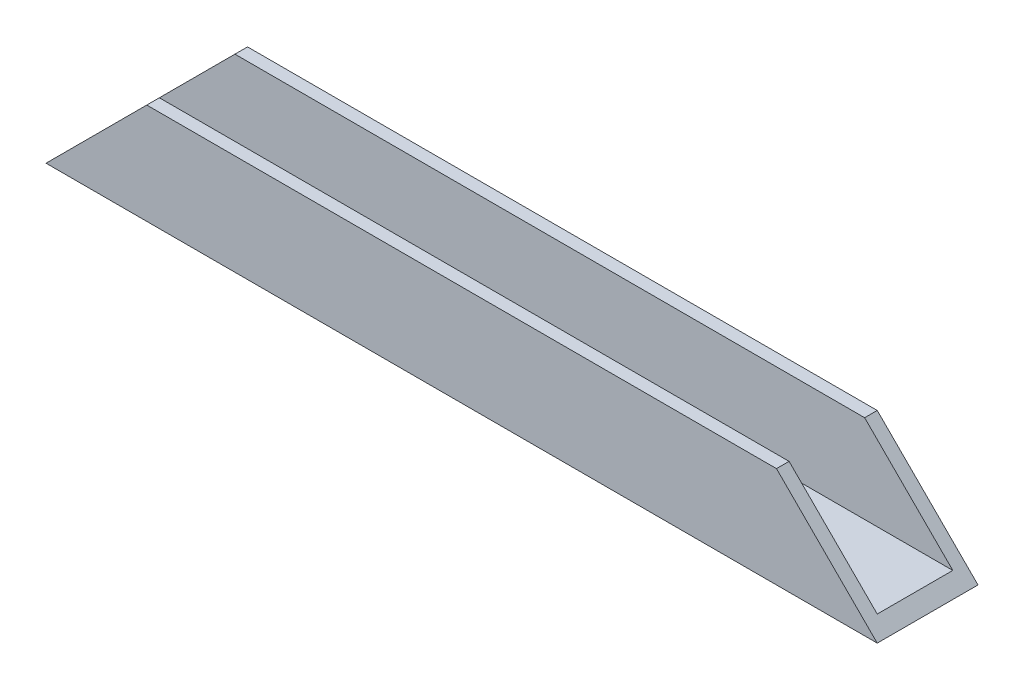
ISO-10303-21;
HEADER;
FILE_DESCRIPTION(('STEP AP214'),'2;1');
FILE_NAME('part.step','',(''),(''),'','','');
FILE_SCHEMA(('AUTOMOTIVE_DESIGN { 1 0 10303 214 1 1 1 1 }'));
ENDSEC;
DATA;
#1=APPLICATION_CONTEXT('core data for automotive mechanical design processes');
#2=APPLICATION_PROTOCOL_DEFINITION('international standard','automotive_design',2000,#1);
#3=PRODUCT_CONTEXT('',#1,'mechanical');
#4=PRODUCT('Part','Part','',(#3));
#5=PRODUCT_RELATED_PRODUCT_CATEGORY('part','',(#4));
#6=PRODUCT_DEFINITION_FORMATION('','',#4);
#7=PRODUCT_DEFINITION_CONTEXT('part definition',#1,'design');
#8=PRODUCT_DEFINITION('design','',#6,#7);
#9=PRODUCT_DEFINITION_SHAPE('','',#8);
#10=(LENGTH_UNIT() NAMED_UNIT(*) SI_UNIT(.MILLI.,.METRE.));
#11=(NAMED_UNIT(*) PLANE_ANGLE_UNIT() SI_UNIT($,.RADIAN.));
#12=(NAMED_UNIT(*) SI_UNIT($,.STERADIAN.) SOLID_ANGLE_UNIT());
#13=UNCERTAINTY_MEASURE_WITH_UNIT(LENGTH_MEASURE(1.E-05),#10,'distance_accuracy_value','');
#14=(GEOMETRIC_REPRESENTATION_CONTEXT(3) GLOBAL_UNCERTAINTY_ASSIGNED_CONTEXT((#13)) GLOBAL_UNIT_ASSIGNED_CONTEXT((#10,
#11,#12)) REPRESENTATION_CONTEXT('',''));
#15=CARTESIAN_POINT('',(0.,0.,0.));
#16=DIRECTION('',(0.,0.,1.));
#17=DIRECTION('',(1.,0.,0.));
#18=AXIS2_PLACEMENT_3D('',#15,#16,#17);
#19=CARTESIAN_POINT('',(104.775,22.225,9.525));
#20=DIRECTION('',(0.,0.,1.));
#21=DIRECTION('',(0.,-1.,0.));
#22=AXIS2_PLACEMENT_3D('',#19,#20,#21);
#23=PLANE('',#22);
#24=DIRECTION('',(-0.707106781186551,-0.707106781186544,0.));
#25=VECTOR('',#24,1.);
#26=CARTESIAN_POINT('',(12.7000000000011,114.3,9.52500000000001));
#27=LINE('',#26,#25);
#28=CARTESIAN_POINT('',(-79.3749999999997,22.225,9.525));
#29=VERTEX_POINT('',#28);
#30=CARTESIAN_POINT('',(-101.6,0.,9.525));
#31=VERTEX_POINT('',#30);
#32=EDGE_CURVE('E148',#29,#31,#27,.T.);
#33=ORIENTED_EDGE('',*,*,#32,.F.);
#34=DIRECTION('',(-1.,0.,0.));
#35=VECTOR('',#34,1.);
#36=CARTESIAN_POINT('',(104.775,22.225,9.525));
#37=LINE('',#36,#35);
#38=CARTESIAN_POINT('',(79.3749999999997,22.225,9.525));
#39=VERTEX_POINT('',#38);
#40=EDGE_CURVE('E12',#39,#29,#37,.T.);
#41=ORIENTED_EDGE('',*,*,#40,.F.);
#42=DIRECTION('',(-0.707106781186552,0.707106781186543,0.));
#43=VECTOR('',#42,1.);
#44=CARTESIAN_POINT('',(92.075,9.52499999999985,9.525));
#45=LINE('',#44,#43);
#46=CARTESIAN_POINT('',(101.6,0.,9.525));
#47=VERTEX_POINT('',#46);
#48=EDGE_CURVE('E154',#47,#39,#45,.T.);
#49=ORIENTED_EDGE('',*,*,#48,.F.);
#50=DIRECTION('',(-1.,0.,0.));
#51=VECTOR('',#50,1.);
#52=CARTESIAN_POINT('',(104.775,0.,9.525));
#53=LINE('',#52,#51);
#54=EDGE_CURVE('E100',#47,#31,#53,.T.);
#55=ORIENTED_EDGE('',*,*,#54,.T.);
#56=EDGE_LOOP('',(#33,#41,#49,#55));
#57=FACE_BOUND('',#56,.T.);
#58=ADVANCED_FACE('F34',(#57),#23,.F.);
#59=CARTESIAN_POINT('',(104.775,22.225,12.7));
#60=DIRECTION('',(0.,-1.,0.));
#61=DIRECTION('',(0.,0.,-1.));
#62=AXIS2_PLACEMENT_3D('',#59,#60,#61);
#63=PLANE('',#62);
#64=DIRECTION('',(0.,0.,1.));
#65=VECTOR('',#64,1.);
#66=CARTESIAN_POINT('',(-79.3749999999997,22.225,-12.7));
#67=LINE('',#66,#65);
#68=CARTESIAN_POINT('',(-79.3749999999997,22.225,12.7));
#69=VERTEX_POINT('',#68);
#70=EDGE_CURVE('E133',#29,#69,#67,.T.);
#71=ORIENTED_EDGE('',*,*,#70,.T.);
#72=DIRECTION('',(-1.,0.,0.));
#73=VECTOR('',#72,1.);
#74=CARTESIAN_POINT('',(104.775,22.225,12.7));
#75=LINE('',#74,#73);
#76=CARTESIAN_POINT('',(79.3749999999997,22.225,12.7));
#77=VERTEX_POINT('',#76);
#78=EDGE_CURVE('E42',#77,#69,#75,.T.);
#79=ORIENTED_EDGE('',*,*,#78,.F.);
#80=DIRECTION('',(0.,0.,1.));
#81=VECTOR('',#80,1.);
#82=CARTESIAN_POINT('',(79.3749999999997,22.225,-12.7));
#83=LINE('',#82,#81);
#84=EDGE_CURVE('E131',#39,#77,#83,.T.);
#85=ORIENTED_EDGE('',*,*,#84,.F.);
#86=ORIENTED_EDGE('',*,*,#40,.T.);
#87=EDGE_LOOP('',(#71,#79,#85,#86));
#88=FACE_BOUND('',#87,.T.);
#89=ADVANCED_FACE('F130',(#88),#63,.F.);
#90=CARTESIAN_POINT('',(104.775,-3.175,12.7));
#91=DIRECTION('',(0.,0.,-1.));
#92=DIRECTION('',(0.,1.,0.));
#93=AXIS2_PLACEMENT_3D('',#90,#91,#92);
#94=PLANE('',#93);
#95=DIRECTION('',(-0.707106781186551,-0.707106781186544,0.));
#96=VECTOR('',#95,1.);
#97=CARTESIAN_POINT('',(-104.775,-3.175,12.7));
#98=LINE('',#97,#96);
#99=CARTESIAN_POINT('',(-104.775,-3.175,12.7));
#100=VERTEX_POINT('',#99);
#101=EDGE_CURVE('E112',#69,#100,#98,.T.);
#102=ORIENTED_EDGE('',*,*,#101,.T.);
#103=DIRECTION('',(-1.,0.,0.));
#104=VECTOR('',#103,1.);
#105=CARTESIAN_POINT('',(104.775,-3.175,12.7));
#106=LINE('',#105,#104);
#107=CARTESIAN_POINT('',(104.775,-3.175,12.7));
#108=VERTEX_POINT('',#107);
#109=EDGE_CURVE('E116',#108,#100,#106,.T.);
#110=ORIENTED_EDGE('',*,*,#109,.F.);
#111=DIRECTION('',(-0.707106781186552,0.707106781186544,0.));
#112=VECTOR('',#111,1.);
#113=CARTESIAN_POINT('',(79.3749999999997,22.225,12.7));
#114=LINE('',#113,#112);
#115=EDGE_CURVE('E48',#108,#77,#114,.T.);
#116=ORIENTED_EDGE('',*,*,#115,.T.);
#117=ORIENTED_EDGE('',*,*,#78,.T.);
#118=EDGE_LOOP('',(#102,#110,#116,#117));
#119=FACE_BOUND('',#118,.T.);
#120=ADVANCED_FACE('F126',(#119),#94,.F.);
#121=CARTESIAN_POINT('',(104.775,22.225,-12.7));
#122=DIRECTION('',(0.,0.,1.));
#123=DIRECTION('',(0.,-1.,0.));
#124=AXIS2_PLACEMENT_3D('',#121,#122,#123);
#125=PLANE('',#124);
#126=DIRECTION('',(-0.707106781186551,-0.707106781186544,0.));
#127=VECTOR('',#126,1.);
#128=CARTESIAN_POINT('',(-104.775,-3.175,-12.7));
#129=LINE('',#128,#127);
#130=CARTESIAN_POINT('',(-79.3749999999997,22.225,-12.7));
#131=VERTEX_POINT('',#130);
#132=CARTESIAN_POINT('',(-104.775,-3.175,-12.7));
#133=VERTEX_POINT('',#132);
#134=EDGE_CURVE('E111',#131,#133,#129,.T.);
#135=ORIENTED_EDGE('',*,*,#134,.F.);
#136=DIRECTION('',(-1.,0.,0.));
#137=VECTOR('',#136,1.);
#138=CARTESIAN_POINT('',(104.775,22.225,-12.7));
#139=LINE('',#138,#137);
#140=CARTESIAN_POINT('',(79.3749999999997,22.225,-12.7));
#141=VERTEX_POINT('',#140);
#142=EDGE_CURVE('E110',#141,#131,#139,.T.);
#143=ORIENTED_EDGE('',*,*,#142,.F.);
#144=DIRECTION('',(-0.707106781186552,0.707106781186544,0.));
#145=VECTOR('',#144,1.);
#146=CARTESIAN_POINT('',(79.3749999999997,22.225,-12.7));
#147=LINE('',#146,#145);
#148=CARTESIAN_POINT('',(104.775,-3.175,-12.7));
#149=VERTEX_POINT('',#148);
#150=EDGE_CURVE('E95',#149,#141,#147,.T.);
#151=ORIENTED_EDGE('',*,*,#150,.F.);
#152=DIRECTION('',(-1.,0.,0.));
#153=VECTOR('',#152,1.);
#154=CARTESIAN_POINT('',(104.775,-3.175,-12.7));
#155=LINE('',#154,#153);
#156=EDGE_CURVE('E108',#149,#133,#155,.T.);
#157=ORIENTED_EDGE('',*,*,#156,.T.);
#158=EDGE_LOOP('',(#135,#143,#151,#157));
#159=FACE_BOUND('',#158,.T.);
#160=ADVANCED_FACE('F107',(#159),#125,.F.);
#161=CARTESIAN_POINT('',(104.775,22.225,-9.52499999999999));
#162=DIRECTION('',(0.,-1.,0.));
#163=DIRECTION('',(0.,0.,-1.));
#164=AXIS2_PLACEMENT_3D('',#161,#162,#163);
#165=PLANE('',#164);
#166=CARTESIAN_POINT('',(-79.3749999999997,22.225,-9.52499999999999));
#167=VERTEX_POINT('',#166);
#168=EDGE_CURVE('E136',#131,#167,#67,.T.);
#169=ORIENTED_EDGE('',*,*,#168,.T.);
#170=DIRECTION('',(-1.,0.,0.));
#171=VECTOR('',#170,1.);
#172=CARTESIAN_POINT('',(104.775,22.225,-9.52499999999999));
#173=LINE('',#172,#171);
#174=CARTESIAN_POINT('',(79.3749999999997,22.225,-9.52499999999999));
#175=VERTEX_POINT('',#174);
#176=EDGE_CURVE('E119',#175,#167,#173,.T.);
#177=ORIENTED_EDGE('',*,*,#176,.F.);
#178=EDGE_CURVE('E137',#141,#175,#83,.T.);
#179=ORIENTED_EDGE('',*,*,#178,.F.);
#180=ORIENTED_EDGE('',*,*,#142,.T.);
#181=EDGE_LOOP('',(#169,#177,#179,#180));
#182=FACE_BOUND('',#181,.T.);
#183=ADVANCED_FACE('F169',(#182),#165,.F.);
#184=CARTESIAN_POINT('',(104.775,0.,-9.525));
#185=DIRECTION('',(0.,0.,-1.));
#186=DIRECTION('',(0.,1.,0.));
#187=AXIS2_PLACEMENT_3D('',#184,#185,#186);
#188=PLANE('',#187);
#189=DIRECTION('',(0.707106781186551,0.707106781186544,0.));
#190=VECTOR('',#189,1.);
#191=CARTESIAN_POINT('',(1.58750000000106,103.1875,-9.52499999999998));
#192=LINE('',#191,#190);
#193=CARTESIAN_POINT('',(-101.6,0.,-9.52499999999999));
#194=VERTEX_POINT('',#193);
#195=EDGE_CURVE('E146',#194,#167,#192,.T.);
#196=ORIENTED_EDGE('',*,*,#195,.F.);
#197=DIRECTION('',(-1.,0.,0.));
#198=VECTOR('',#197,1.);
#199=CARTESIAN_POINT('',(104.775,0.,-9.525));
#200=LINE('',#199,#198);
#201=CARTESIAN_POINT('',(101.6,0.,-9.525));
#202=VERTEX_POINT('',#201);
#203=EDGE_CURVE('E159',#202,#194,#200,.T.);
#204=ORIENTED_EDGE('',*,*,#203,.F.);
#205=DIRECTION('',(0.707106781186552,-0.707106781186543,0.));
#206=VECTOR('',#205,1.);
#207=CARTESIAN_POINT('',(103.1875,-1.58750000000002,-9.525));
#208=LINE('',#207,#206);
#209=EDGE_CURVE('E152',#175,#202,#208,.T.);
#210=ORIENTED_EDGE('',*,*,#209,.F.);
#211=ORIENTED_EDGE('',*,*,#176,.T.);
#212=EDGE_LOOP('',(#196,#204,#210,#211));
#213=FACE_BOUND('',#212,.T.);
#214=ADVANCED_FACE('F166',(#213),#188,.F.);
#215=CARTESIAN_POINT('',(104.775,0.,9.525));
#216=DIRECTION('',(0.,-1.,0.));
#217=DIRECTION('',(0.,0.,-1.));
#218=AXIS2_PLACEMENT_3D('',#215,#216,#217);
#219=PLANE('',#218);
#220=DIRECTION('',(0.,0.,-1.));
#221=VECTOR('',#220,1.);
#222=CARTESIAN_POINT('',(-101.6,0.,9.52499999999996));
#223=LINE('',#222,#221);
#224=EDGE_CURVE('E140',#31,#194,#223,.T.);
#225=ORIENTED_EDGE('',*,*,#224,.F.);
#226=ORIENTED_EDGE('',*,*,#54,.F.);
#227=DIRECTION('',(0.,0.,1.));
#228=VECTOR('',#227,1.);
#229=CARTESIAN_POINT('',(101.6,0.,9.525));
#230=LINE('',#229,#228);
#231=EDGE_CURVE('E150',#202,#47,#230,.T.);
#232=ORIENTED_EDGE('',*,*,#231,.F.);
#233=ORIENTED_EDGE('',*,*,#203,.T.);
#234=EDGE_LOOP('',(#225,#226,#232,#233));
#235=FACE_BOUND('',#234,.T.);
#236=ADVANCED_FACE('F178',(#235),#219,.F.);
#237=CARTESIAN_POINT('',(104.775,-3.175,-12.7));
#238=DIRECTION('',(0.,1.,0.));
#239=DIRECTION('',(0.,0.,1.));
#240=AXIS2_PLACEMENT_3D('',#237,#238,#239);
#241=PLANE('',#240);
#242=DIRECTION('',(0.,0.,-1.));
#243=VECTOR('',#242,1.);
#244=CARTESIAN_POINT('',(-104.775,-3.175,-12.7));
#245=LINE('',#244,#243);
#246=EDGE_CURVE('E101',#100,#133,#245,.T.);
#247=ORIENTED_EDGE('',*,*,#246,.T.);
#248=ORIENTED_EDGE('',*,*,#156,.F.);
#249=DIRECTION('',(0.,0.,-1.));
#250=VECTOR('',#249,1.);
#251=CARTESIAN_POINT('',(104.775,-3.175,-12.7));
#252=LINE('',#251,#250);
#253=EDGE_CURVE('E92',#108,#149,#252,.T.);
#254=ORIENTED_EDGE('',*,*,#253,.F.);
#255=ORIENTED_EDGE('',*,*,#109,.T.);
#256=EDGE_LOOP('',(#247,#248,#254,#255));
#257=FACE_BOUND('',#256,.T.);
#258=ADVANCED_FACE('F115',(#257),#241,.F.);
#259=CARTESIAN_POINT('',(-104.775,-3.175,-12.7));
#260=DIRECTION('',(-0.707106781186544,0.707106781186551,0.));
#261=DIRECTION('',(-0.707106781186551,-0.707106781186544,0.));
#262=AXIS2_PLACEMENT_3D('',#259,#260,#261);
#263=PLANE('',#262);
#264=ORIENTED_EDGE('',*,*,#32,.T.);
#265=ORIENTED_EDGE('',*,*,#224,.T.);
#266=ORIENTED_EDGE('',*,*,#195,.T.);
#267=ORIENTED_EDGE('',*,*,#168,.F.);
#268=ORIENTED_EDGE('',*,*,#134,.T.);
#269=ORIENTED_EDGE('',*,*,#246,.F.);
#270=ORIENTED_EDGE('',*,*,#101,.F.);
#271=ORIENTED_EDGE('',*,*,#70,.F.);
#272=EDGE_LOOP('',(#264,#265,#266,#267,#268,#269,#270,#271));
#273=FACE_BOUND('',#272,.T.);
#274=ADVANCED_FACE('F170',(#273),#263,.T.);
#275=CARTESIAN_POINT('',(79.3749999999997,22.225,-12.7));
#276=DIRECTION('',(0.707106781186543,0.707106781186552,0.));
#277=DIRECTION('',(-0.707106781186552,0.707106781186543,0.));
#278=AXIS2_PLACEMENT_3D('',#275,#276,#277);
#279=PLANE('',#278);
#280=ORIENTED_EDGE('',*,*,#48,.T.);
#281=ORIENTED_EDGE('',*,*,#84,.T.);
#282=ORIENTED_EDGE('',*,*,#115,.F.);
#283=ORIENTED_EDGE('',*,*,#253,.T.);
#284=ORIENTED_EDGE('',*,*,#150,.T.);
#285=ORIENTED_EDGE('',*,*,#178,.T.);
#286=ORIENTED_EDGE('',*,*,#209,.T.);
#287=ORIENTED_EDGE('',*,*,#231,.T.);
#288=EDGE_LOOP('',(#280,#281,#282,#283,#284,#285,#286,#287));
#289=FACE_BOUND('',#288,.T.);
#290=ADVANCED_FACE('F94',(#289),#279,.T.);
#291=CLOSED_SHELL('',(#58,#89,#120,#160,#183,#214,#236,#258,#274,#290));
#292=MANIFOLD_SOLID_BREP('B2',#291);
#293=ADVANCED_BREP_SHAPE_REPRESENTATION('',(#18,#292),#14);
#294=SHAPE_DEFINITION_REPRESENTATION(#9,#293);
ENDSEC;
END-ISO-10303-21;
